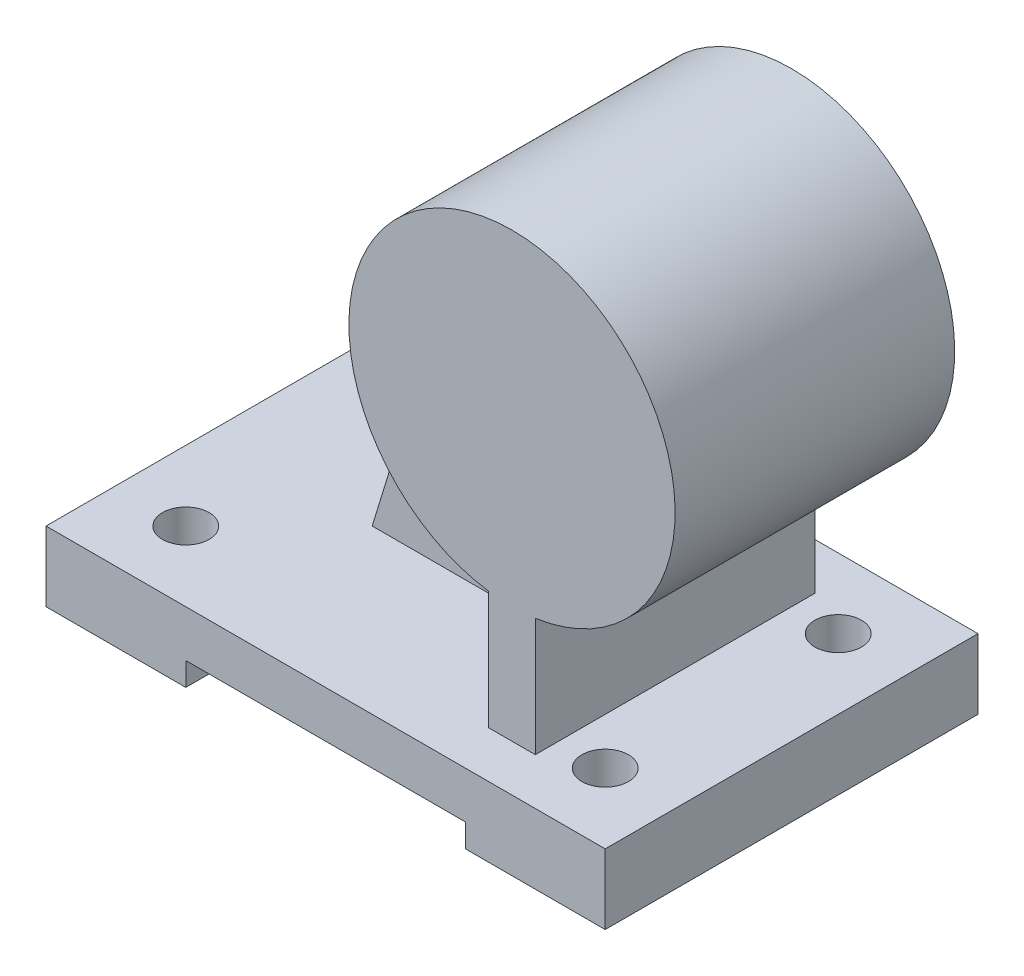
from build123d import *

# Parameters (mm, degrees)
SKETCH1_W           = 3048
SKETCH1_H           = 2032
BOSS_EXTRUDE1_DEPTH = 381
SKETCH3_W           = 1524
SKETCH3_H           = 127
CUT_EXTRUDE1_DEPTH  = 3684
SKETCH4_R           = 127
CUT_EXTRUDE2_DEPTH  = 3684
BOSS_EXTRUDE2_DEPTH = 1524
BOSS_EXTRUDE3_DEPTH = 127


with BuildPart() as part:
    # Sketch1 → Boss-Extrude1 (new body)
    with BuildSketch(Plane(origin=(0, 0, 0), x_dir=(1, 0, 0), z_dir=(0, 1, 0))):
        with Locations((1524, 1016)):
            Rectangle(SKETCH1_W, SKETCH1_H)
    extrude(amount=BOSS_EXTRUDE1_DEPTH)

    # Sketch3 → Cut-Extrude1 (cut, through all)
    with BuildSketch(Plane.XY):
        with Locations((1524, 63.5)):
            Rectangle(SKETCH3_W, SKETCH3_H)
    extrude(amount=-CUT_EXTRUDE1_DEPTH, mode=Mode.SUBTRACT)

    # Sketch4 → Cut-Extrude2 (cut, through all)
    with BuildSketch(Plane(origin=(0, 381, 0), x_dir=(1, 0, 0), z_dir=(0, 1, 0))):
        with Locations(Location((381, 381, 0), (0, 0, 270))):
            Circle(SKETCH4_R)
        with Locations(Location((381, 1651, 0), (0, 0, 90))):
            Circle(SKETCH4_R)
        with Locations(Location((2667, 381, 0), (0, 0, 90))):
            Circle(SKETCH4_R)
        with Locations(Location((2667, 1651, 0), (0, 0, 270))):
            Circle(SKETCH4_R)
    extrude(amount=-CUT_EXTRUDE2_DEPTH, mode=Mode.SUBTRACT)

    # Sketch5 → Boss-Extrude2 (add)
    with BuildSketch(Plane.XY.offset(-254)):
        with BuildLine():
            Line((2413, 381), (2159, 381))
            Line((2159, 381), (2159, 1025.118189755))
            ThreePointArc((2159, 1025.118189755), (2286, 2794), (2413, 1025.118189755))
            Line((2413, 1025.118189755), (2413, 381))
        make_face()
    extrude(amount=-BOSS_EXTRUDE2_DEPTH)

    # Sketch6 → Boss-Extrude3 (add, symmetric)
    with BuildSketch(Plane.XY.offset(-1016)):
        Polygon((889, 381), (1436.037964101, 2165.548532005), (2266.719059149, 2165.548532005), (2266.719059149, 381), align=None)
    extrude(amount=BOSS_EXTRUDE3_DEPTH, both=True)


solid = part.part
